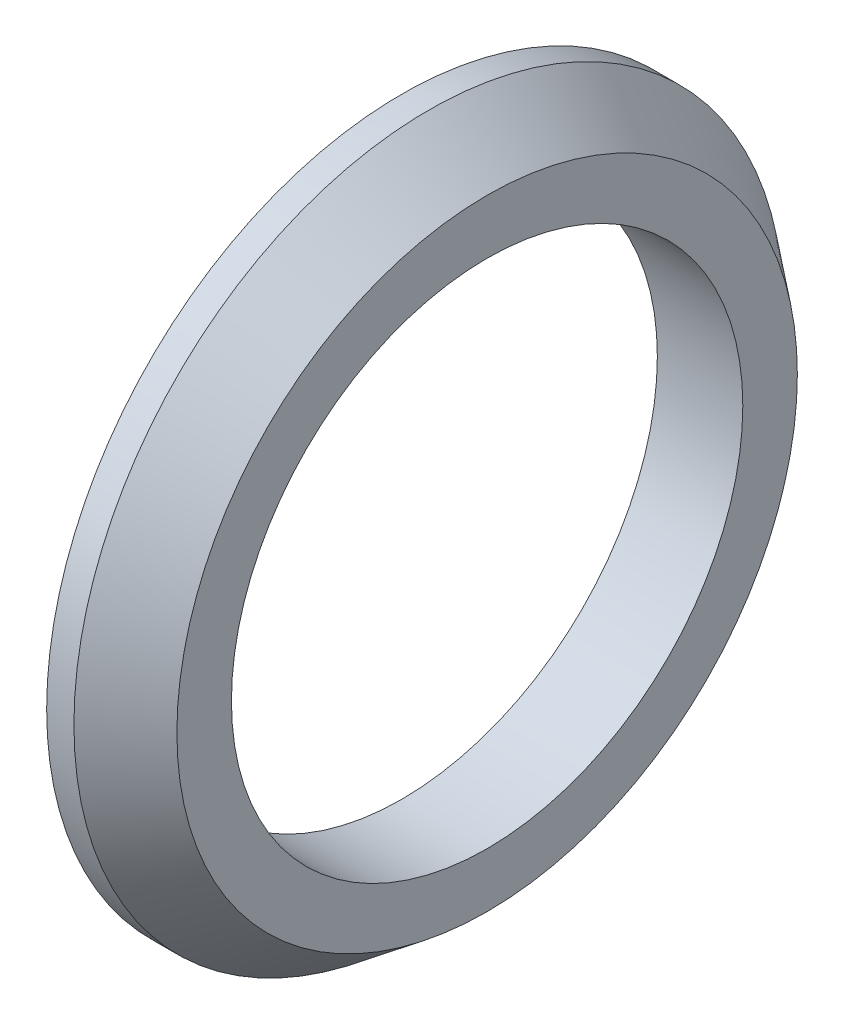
ISO-10303-21;
HEADER;
FILE_DESCRIPTION(('STEP AP214'),'2;1');
FILE_NAME('part.step','',(''),(''),'','','');
FILE_SCHEMA(('AUTOMOTIVE_DESIGN { 1 0 10303 214 1 1 1 1 }'));
ENDSEC;
DATA;
#1=APPLICATION_CONTEXT('core data for automotive mechanical design processes');
#2=APPLICATION_PROTOCOL_DEFINITION('international standard','automotive_design',2000,#1);
#3=PRODUCT_CONTEXT('',#1,'mechanical');
#4=PRODUCT('Part','Part','',(#3));
#5=PRODUCT_RELATED_PRODUCT_CATEGORY('part','',(#4));
#6=PRODUCT_DEFINITION_FORMATION('','',#4);
#7=PRODUCT_DEFINITION_CONTEXT('part definition',#1,'design');
#8=PRODUCT_DEFINITION('design','',#6,#7);
#9=PRODUCT_DEFINITION_SHAPE('','',#8);
#10=(LENGTH_UNIT() NAMED_UNIT(*) SI_UNIT(.MILLI.,.METRE.));
#11=(NAMED_UNIT(*) PLANE_ANGLE_UNIT() SI_UNIT($,.RADIAN.));
#12=(NAMED_UNIT(*) SI_UNIT($,.STERADIAN.) SOLID_ANGLE_UNIT());
#13=UNCERTAINTY_MEASURE_WITH_UNIT(LENGTH_MEASURE(1.E-05),#10,'distance_accuracy_value','');
#14=(GEOMETRIC_REPRESENTATION_CONTEXT(3) GLOBAL_UNCERTAINTY_ASSIGNED_CONTEXT((#13)) GLOBAL_UNIT_ASSIGNED_CONTEXT((#10,
#11,#12)) REPRESENTATION_CONTEXT('',''));
#15=CARTESIAN_POINT('',(0.,0.,0.));
#16=DIRECTION('',(0.,0.,1.));
#17=DIRECTION('',(1.,0.,0.));
#18=AXIS2_PLACEMENT_3D('',#15,#16,#17);
#19=CARTESIAN_POINT('',(0.,19.8374,0.));
#20=DIRECTION('',(1.,0.,0.));
#21=DIRECTION('',(0.,0.,-1.));
#22=AXIS2_PLACEMENT_3D('',#19,#20,#21);
#23=PLANE('',#22);
#24=CARTESIAN_POINT('',(0.,0.,0.));
#25=DIRECTION('',(-1.,0.,0.));
#26=DIRECTION('',(0.,0.,1.));
#27=AXIS2_PLACEMENT_3D('',#24,#25,#26);
#28=CIRCLE('',#27,14.2875);
#29=CARTESIAN_POINT('',(0.,0.,14.2875));
#30=VERTEX_POINT('',#29);
#31=EDGE_CURVE('E10',#30,#30,#28,.T.);
#32=ORIENTED_EDGE('',*,*,#31,.F.);
#33=EDGE_LOOP('',(#32));
#34=FACE_BOUND('',#33,.T.);
#35=CARTESIAN_POINT('',(0.,0.,0.));
#36=DIRECTION('',(-1.,0.,0.));
#37=DIRECTION('',(0.,0.,1.));
#38=AXIS2_PLACEMENT_3D('',#35,#36,#37);
#39=CIRCLE('',#38,19.8374);
#40=CARTESIAN_POINT('',(0.,0.,19.8374));
#41=VERTEX_POINT('',#40);
#42=EDGE_CURVE('E50',#41,#41,#39,.T.);
#43=ORIENTED_EDGE('',*,*,#42,.T.);
#44=EDGE_LOOP('',(#43));
#45=FACE_BOUND('',#44,.T.);
#46=ADVANCED_FACE('F31',(#34,#45),#23,.F.);
#47=CARTESIAN_POINT('',(0.,0.,0.));
#48=DIRECTION('',(-1.,0.,0.));
#49=DIRECTION('',(0.,0.,1.));
#50=AXIS2_PLACEMENT_3D('',#47,#48,#49);
#51=CYLINDRICAL_SURFACE('',#50,14.2875);
#52=CARTESIAN_POINT('',(4.7752,0.,0.));
#53=DIRECTION('',(-1.,0.,0.));
#54=DIRECTION('',(0.,0.,1.));
#55=AXIS2_PLACEMENT_3D('',#52,#53,#54);
#56=CIRCLE('',#55,14.2875);
#57=CARTESIAN_POINT('',(4.7752,0.,14.2875));
#58=VERTEX_POINT('',#57);
#59=EDGE_CURVE('E37',#58,#58,#56,.T.);
#60=ORIENTED_EDGE('',*,*,#59,.F.);
#61=EDGE_LOOP('',(#60));
#62=FACE_BOUND('',#61,.T.);
#63=ORIENTED_EDGE('',*,*,#31,.T.);
#64=EDGE_LOOP('',(#63));
#65=FACE_BOUND('',#64,.T.);
#66=ADVANCED_FACE('F69',(#62,#65),#51,.F.);
#67=CARTESIAN_POINT('',(4.7752,14.2875,0.));
#68=DIRECTION('',(-1.,0.,0.));
#69=DIRECTION('',(0.,0.,1.));
#70=AXIS2_PLACEMENT_3D('',#67,#68,#69);
#71=PLANE('',#70);
#72=CARTESIAN_POINT('',(4.7752,0.,0.));
#73=DIRECTION('',(-1.,0.,0.));
#74=DIRECTION('',(0.,0.,1.));
#75=AXIS2_PLACEMENT_3D('',#72,#73,#74);
#76=CIRCLE('',#75,17.3355);
#77=CARTESIAN_POINT('',(4.7752,0.,17.3355));
#78=VERTEX_POINT('',#77);
#79=EDGE_CURVE('E41',#78,#78,#76,.T.);
#80=ORIENTED_EDGE('',*,*,#79,.F.);
#81=EDGE_LOOP('',(#80));
#82=FACE_BOUND('',#81,.T.);
#83=ORIENTED_EDGE('',*,*,#59,.T.);
#84=EDGE_LOOP('',(#83));
#85=FACE_BOUND('',#84,.T.);
#86=ADVANCED_FACE('F64',(#82,#85),#71,.F.);
#87=CARTESIAN_POINT('',(4.7752,0.,0.));
#88=DIRECTION('',(-1.,0.,0.));
#89=DIRECTION('',(0.,0.,1.));
#90=AXIS2_PLACEMENT_3D('',#87,#88,#89);
#91=CONICAL_SURFACE('',#90,17.3355,0.655884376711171);
#92=CARTESIAN_POINT('',(1.524,0.,0.));
#93=DIRECTION('',(-1.,0.,0.));
#94=DIRECTION('',(0.,0.,1.));
#95=AXIS2_PLACEMENT_3D('',#92,#93,#94);
#96=CIRCLE('',#95,19.8374);
#97=CARTESIAN_POINT('',(1.524,0.,19.8374));
#98=VERTEX_POINT('',#97);
#99=EDGE_CURVE('E45',#98,#98,#96,.T.);
#100=ORIENTED_EDGE('',*,*,#99,.F.);
#101=EDGE_LOOP('',(#100));
#102=FACE_BOUND('',#101,.T.);
#103=ORIENTED_EDGE('',*,*,#79,.T.);
#104=EDGE_LOOP('',(#103));
#105=FACE_BOUND('',#104,.T.);
#106=ADVANCED_FACE('F58',(#102,#105),#91,.T.);
#107=CARTESIAN_POINT('',(0.,0.,0.));
#108=DIRECTION('',(-1.,0.,0.));
#109=DIRECTION('',(0.,0.,1.));
#110=AXIS2_PLACEMENT_3D('',#107,#108,#109);
#111=CYLINDRICAL_SURFACE('',#110,19.8374);
#112=ORIENTED_EDGE('',*,*,#42,.F.);
#113=EDGE_LOOP('',(#112));
#114=FACE_BOUND('',#113,.T.);
#115=ORIENTED_EDGE('',*,*,#99,.T.);
#116=EDGE_LOOP('',(#115));
#117=FACE_BOUND('',#116,.T.);
#118=ADVANCED_FACE('F55',(#114,#117),#111,.T.);
#119=CLOSED_SHELL('',(#46,#66,#86,#106,#118));
#120=MANIFOLD_SOLID_BREP('B2',#119);
#121=ADVANCED_BREP_SHAPE_REPRESENTATION('',(#18,#120),#14);
#122=SHAPE_DEFINITION_REPRESENTATION(#9,#121);
ENDSEC;
END-ISO-10303-21;
